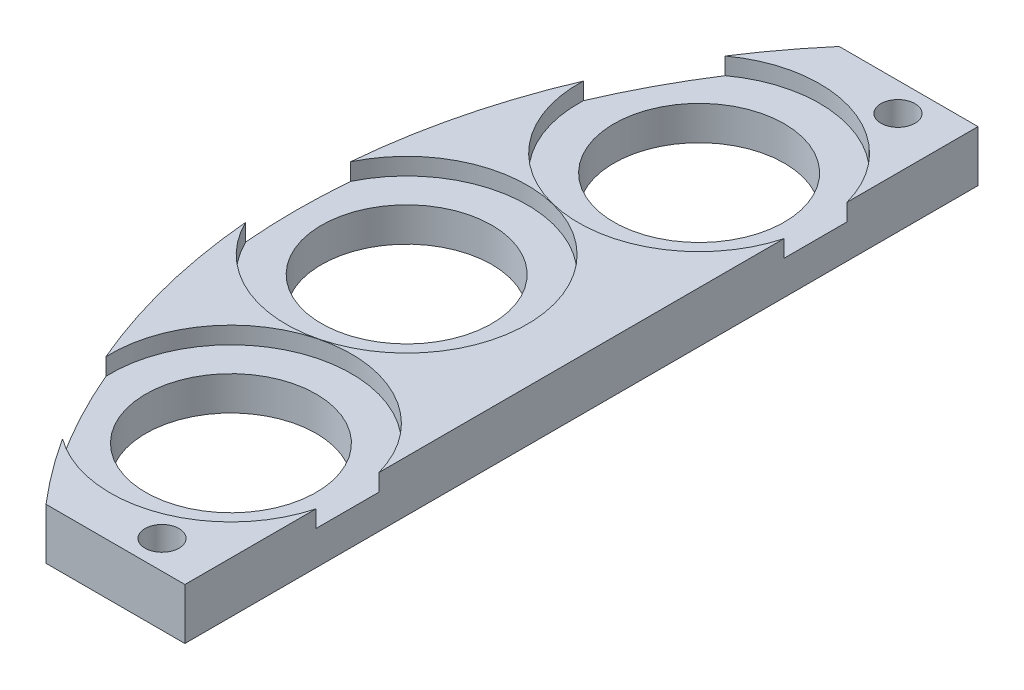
ISO-10303-21;
HEADER;
FILE_DESCRIPTION(('STEP AP214'),'2;1');
FILE_NAME('part.step','',(''),(''),'','','');
FILE_SCHEMA(('AUTOMOTIVE_DESIGN { 1 0 10303 214 1 1 1 1 }'));
ENDSEC;
DATA;
#1=APPLICATION_CONTEXT('core data for automotive mechanical design processes');
#2=APPLICATION_PROTOCOL_DEFINITION('international standard','automotive_design',2000,#1);
#3=PRODUCT_CONTEXT('',#1,'mechanical');
#4=PRODUCT('Part','Part','',(#3));
#5=PRODUCT_RELATED_PRODUCT_CATEGORY('part','',(#4));
#6=PRODUCT_DEFINITION_FORMATION('','',#4);
#7=PRODUCT_DEFINITION_CONTEXT('part definition',#1,'design');
#8=PRODUCT_DEFINITION('design','',#6,#7);
#9=PRODUCT_DEFINITION_SHAPE('','',#8);
#10=(LENGTH_UNIT() NAMED_UNIT(*) SI_UNIT(.MILLI.,.METRE.));
#11=(NAMED_UNIT(*) PLANE_ANGLE_UNIT() SI_UNIT($,.RADIAN.));
#12=(NAMED_UNIT(*) SI_UNIT($,.STERADIAN.) SOLID_ANGLE_UNIT());
#13=UNCERTAINTY_MEASURE_WITH_UNIT(LENGTH_MEASURE(1.E-05),#10,'distance_accuracy_value','');
#14=(GEOMETRIC_REPRESENTATION_CONTEXT(3) GLOBAL_UNCERTAINTY_ASSIGNED_CONTEXT((#13)) GLOBAL_UNIT_ASSIGNED_CONTEXT((#10,
#11,#12)) REPRESENTATION_CONTEXT('',''));
#15=CARTESIAN_POINT('',(0.,0.,0.));
#16=DIRECTION('',(0.,0.,1.));
#17=DIRECTION('',(1.,0.,0.));
#18=AXIS2_PLACEMENT_3D('',#15,#16,#17);
#19=CARTESIAN_POINT('',(0.,4.7625,0.));
#20=DIRECTION('',(0.,1.,0.));
#21=DIRECTION('',(0.,0.,1.));
#22=AXIS2_PLACEMENT_3D('',#19,#20,#21);
#23=PLANE('',#22);
#24=CARTESIAN_POINT('',(-40.9991196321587,4.7625,21.7996185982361));
#25=DIRECTION('',(0.,1.,0.));
#26=DIRECTION('',(0.,0.,1.));
#27=AXIS2_PLACEMENT_3D('',#24,#25,#26);
#28=CIRCLE('',#27,11.2268);
#29=CARTESIAN_POINT('',(-30.1625,4.7625,18.8655577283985));
#30=VERTEX_POINT('',#29);
#31=CARTESIAN_POINT('',(-52.2176106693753,4.7625,22.2314716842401));
#32=VERTEX_POINT('',#31);
#33=EDGE_CURVE('E154',#30,#32,#28,.T.);
#34=ORIENTED_EDGE('',*,*,#33,.F.);
#35=DIRECTION('',(0.,0.,-1.));
#36=VECTOR('',#35,1.);
#37=CARTESIAN_POINT('',(-30.1625,4.7625,-36.93795));
#38=LINE('',#37,#36);
#39=CARTESIAN_POINT('',(-30.1625,4.7625,-18.8655577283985));
#40=VERTEX_POINT('',#39);
#41=EDGE_CURVE('E170',#30,#40,#38,.T.);
#42=ORIENTED_EDGE('',*,*,#41,.T.);
#43=CARTESIAN_POINT('',(-40.9991196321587,4.7625,-21.7996185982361));
#44=DIRECTION('',(0.,1.,0.));
#45=DIRECTION('',(0.,0.,1.));
#46=AXIS2_PLACEMENT_3D('',#43,#44,#45);
#47=CIRCLE('',#46,11.2268);
#48=CARTESIAN_POINT('',(-52.2176106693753,4.7625,-22.2314716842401));
#49=VERTEX_POINT('',#48);
#50=EDGE_CURVE('E211',#49,#40,#47,.T.);
#51=ORIENTED_EDGE('',*,*,#50,.F.);
#52=CARTESIAN_POINT('',(0.,4.7625,0.));
#53=DIRECTION('',(0.,1.,0.));
#54=DIRECTION('',(0.,0.,1.));
#55=AXIS2_PLACEMENT_3D('',#52,#53,#54);
#56=CIRCLE('',#55,56.753125);
#57=CARTESIAN_POINT('',(-56.5424574,4.7625,-4.88545887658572));
#58=VERTEX_POINT('',#57);
#59=EDGE_CURVE('E185',#49,#58,#56,.T.);
#60=ORIENTED_EDGE('',*,*,#59,.T.);
#61=CARTESIAN_POINT('',(-46.434375,4.7625,0.));
#62=DIRECTION('',(0.,1.,0.));
#63=DIRECTION('',(0.,0.,1.));
#64=AXIS2_PLACEMENT_3D('',#61,#62,#63);
#65=CIRCLE('',#64,11.2268);
#66=CARTESIAN_POINT('',(-56.5424574,4.7625,4.88545887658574));
#67=VERTEX_POINT('',#66);
#68=EDGE_CURVE('E222',#67,#58,#65,.T.);
#69=ORIENTED_EDGE('',*,*,#68,.F.);
#70=EDGE_CURVE('E402',#67,#32,#56,.T.);
#71=ORIENTED_EDGE('',*,*,#70,.T.);
#72=EDGE_LOOP('',(#34,#42,#51,#60,#69,#71));
#73=FACE_BOUND('',#72,.T.);
#74=ADVANCED_FACE('F38',(#73),#23,.T.);
#75=CARTESIAN_POINT('',(-40.9991196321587,4.7625,21.7996185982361));
#76=DIRECTION('',(0.,-1.,0.));
#77=DIRECTION('',(0.,0.,-1.));
#78=AXIS2_PLACEMENT_3D('',#75,#76,#77);
#79=CYLINDRICAL_SURFACE('',#78,7.9375);
#80=CARTESIAN_POINT('',(-40.9991196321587,0.,21.7996185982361));
#81=DIRECTION('',(0.,1.,0.));
#82=DIRECTION('',(0.,0.,1.));
#83=AXIS2_PLACEMENT_3D('',#80,#81,#82);
#84=CIRCLE('',#83,7.9375);
#85=CARTESIAN_POINT('',(-40.9991196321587,0.,13.8621185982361));
#86=VERTEX_POINT('',#85);
#87=EDGE_CURVE('E196',#86,#86,#84,.T.);
#88=CARTESIAN_POINT('',(-40.9991196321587,3.175,21.7996185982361));
#89=DIRECTION('',(0.,1.,0.));
#90=DIRECTION('',(0.,0.,1.));
#91=AXIS2_PLACEMENT_3D('',#88,#89,#90);
#92=CIRCLE('',#91,7.9375);
#93=CARTESIAN_POINT('',(-40.9991196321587,3.175,13.8621185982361));
#94=VERTEX_POINT('',#93);
#95=EDGE_CURVE('E234',#94,#94,#92,.T.);
#96=CARTESIAN_POINT('',(-40.9991196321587,0.,13.8621185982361));
#97=CARTESIAN_POINT('',(-40.9991196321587,0.0330729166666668,13.8621185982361));
#98=CARTESIAN_POINT('',(-40.9991196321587,0.0661458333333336,13.8621185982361));
#99=CARTESIAN_POINT('',(-40.9991196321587,0.132291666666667,13.8621185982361));
#100=CARTESIAN_POINT('',(-40.9991196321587,0.165364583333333,13.8621185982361));
#101=CARTESIAN_POINT('',(-40.9991196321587,0.231510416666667,13.8621185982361));
#102=CARTESIAN_POINT('',(-40.9991196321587,0.264583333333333,13.8621185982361));
#103=CARTESIAN_POINT('',(-40.9991196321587,0.330729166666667,13.8621185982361));
#104=CARTESIAN_POINT('',(-40.9991196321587,0.363802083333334,13.8621185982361));
#105=CARTESIAN_POINT('',(-40.9991196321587,0.429947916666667,13.8621185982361));
#106=CARTESIAN_POINT('',(-40.9991196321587,0.463020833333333,13.8621185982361));
#107=CARTESIAN_POINT('',(-40.9991196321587,0.529166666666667,13.8621185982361));
#108=CARTESIAN_POINT('',(-40.9991196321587,0.562239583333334,13.8621185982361));
#109=CARTESIAN_POINT('',(-40.9991196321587,0.628385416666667,13.8621185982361));
#110=CARTESIAN_POINT('',(-40.9991196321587,0.661458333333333,13.8621185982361));
#111=CARTESIAN_POINT('',(-40.9991196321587,0.727604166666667,13.8621185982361));
#112=CARTESIAN_POINT('',(-40.9991196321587,0.760677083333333,13.8621185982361));
#113=CARTESIAN_POINT('',(-40.9991196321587,0.826822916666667,13.8621185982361));
#114=CARTESIAN_POINT('',(-40.9991196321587,0.859895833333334,13.8621185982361));
#115=CARTESIAN_POINT('',(-40.9991196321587,0.926041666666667,13.8621185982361));
#116=CARTESIAN_POINT('',(-40.9991196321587,0.959114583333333,13.8621185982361));
#117=CARTESIAN_POINT('',(-40.9991196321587,1.02526041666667,13.8621185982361));
#118=CARTESIAN_POINT('',(-40.9991196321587,1.05833333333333,13.8621185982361));
#119=CARTESIAN_POINT('',(-40.9991196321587,1.12447916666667,13.8621185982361));
#120=CARTESIAN_POINT('',(-40.9991196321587,1.15755208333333,13.8621185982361));
#121=CARTESIAN_POINT('',(-40.9991196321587,1.22369791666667,13.8621185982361));
#122=CARTESIAN_POINT('',(-40.9991196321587,1.25677083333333,13.8621185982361));
#123=CARTESIAN_POINT('',(-40.9991196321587,1.32291666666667,13.8621185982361));
#124=CARTESIAN_POINT('',(-40.9991196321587,1.35598958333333,13.8621185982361));
#125=CARTESIAN_POINT('',(-40.9991196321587,1.42213541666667,13.8621185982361));
#126=CARTESIAN_POINT('',(-40.9991196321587,1.45520833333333,13.8621185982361));
#127=CARTESIAN_POINT('',(-40.9991196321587,1.52135416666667,13.8621185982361));
#128=CARTESIAN_POINT('',(-40.9991196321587,1.55442708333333,13.8621185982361));
#129=CARTESIAN_POINT('',(-40.9991196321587,1.62057291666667,13.8621185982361));
#130=CARTESIAN_POINT('',(-40.9991196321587,1.65364583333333,13.8621185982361));
#131=CARTESIAN_POINT('',(-40.9991196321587,1.71979166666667,13.8621185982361));
#132=CARTESIAN_POINT('',(-40.9991196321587,1.75286458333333,13.8621185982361));
#133=CARTESIAN_POINT('',(-40.9991196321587,1.81901041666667,13.8621185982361));
#134=CARTESIAN_POINT('',(-40.9991196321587,1.85208333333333,13.8621185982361));
#135=CARTESIAN_POINT('',(-40.9991196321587,1.91822916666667,13.8621185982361));
#136=CARTESIAN_POINT('',(-40.9991196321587,1.95130208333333,13.8621185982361));
#137=CARTESIAN_POINT('',(-40.9991196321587,2.01744791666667,13.8621185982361));
#138=CARTESIAN_POINT('',(-40.9991196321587,2.05052083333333,13.8621185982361));
#139=CARTESIAN_POINT('',(-40.9991196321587,2.11666666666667,13.8621185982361));
#140=CARTESIAN_POINT('',(-40.9991196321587,2.14973958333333,13.8621185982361));
#141=CARTESIAN_POINT('',(-40.9991196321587,2.21588541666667,13.8621185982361));
#142=CARTESIAN_POINT('',(-40.9991196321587,2.24895833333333,13.8621185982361));
#143=CARTESIAN_POINT('',(-40.9991196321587,2.31510416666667,13.8621185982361));
#144=CARTESIAN_POINT('',(-40.9991196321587,2.34817708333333,13.8621185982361));
#145=CARTESIAN_POINT('',(-40.9991196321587,2.41432291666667,13.8621185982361));
#146=CARTESIAN_POINT('',(-40.9991196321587,2.44739583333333,13.8621185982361));
#147=CARTESIAN_POINT('',(-40.9991196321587,2.51354166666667,13.8621185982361));
#148=CARTESIAN_POINT('',(-40.9991196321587,2.54661458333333,13.8621185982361));
#149=CARTESIAN_POINT('',(-40.9991196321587,2.61276041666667,13.8621185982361));
#150=CARTESIAN_POINT('',(-40.9991196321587,2.64583333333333,13.8621185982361));
#151=CARTESIAN_POINT('',(-40.9991196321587,2.71197916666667,13.8621185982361));
#152=CARTESIAN_POINT('',(-40.9991196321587,2.74505208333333,13.8621185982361));
#153=CARTESIAN_POINT('',(-40.9991196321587,2.81119791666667,13.8621185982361));
#154=CARTESIAN_POINT('',(-40.9991196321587,2.84427083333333,13.8621185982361));
#155=CARTESIAN_POINT('',(-40.9991196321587,2.91041666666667,13.8621185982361));
#156=CARTESIAN_POINT('',(-40.9991196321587,2.94348958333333,13.8621185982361));
#157=CARTESIAN_POINT('',(-40.9991196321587,3.00963541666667,13.8621185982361));
#158=CARTESIAN_POINT('',(-40.9991196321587,3.04270833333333,13.8621185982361));
#159=CARTESIAN_POINT('',(-40.9991196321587,3.10885416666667,13.8621185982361));
#160=CARTESIAN_POINT('',(-40.9991196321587,3.14192708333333,13.8621185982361));
#161=CARTESIAN_POINT('',(-40.9991196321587,3.175,13.8621185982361));
#162=B_SPLINE_CURVE_WITH_KNOTS('',3,(#96,#97,#98,#99,#100,#101,#102,#103,#104,#105,#106,#107,
#108,#109,#110,#111,#112,#113,#114,#115,#116,#117,#118,#119,#120,#121,#122,#123,#124,#125,#126,
#127,#128,#129,#130,#131,#132,#133,#134,#135,#136,#137,#138,#139,#140,#141,#142,#143,#144,#145,
#146,#147,#148,#149,#150,#151,#152,#153,#154,#155,#156,#157,#158,#159,#160,#161),.UNSPECIFIED.,
.F.,.F.,(4,2,2,2,2,2,2,2,2,2,2,2,2,2,2,2,2,2,2,2,2,2,2,2,2,2,2,2,2,2,2,2,4),(0.,
0.0992187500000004,0.1984375,0.29765625,0.396875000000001,0.49609375,0.5953125,0.69453125,
0.79375,0.89296875,0.9921875,1.09140625,1.190625,1.28984375,1.3890625,1.48828125,1.5875,
1.68671875,1.7859375,1.88515625,1.984375,2.08359375,2.1828125,2.28203125,2.38125,2.48046875,
2.5796875,2.67890625,2.778125,2.87734375,2.9765625,3.07578125,3.175),.UNSPECIFIED.);
#163=EDGE_CURVE('BSEAM265',#86,#94,#162,.T.);
#164=ORIENTED_EDGE('',*,*,#87,.F.);
#165=ORIENTED_EDGE('',*,*,#95,.T.);
#166=ORIENTED_EDGE('',*,*,#163,.T.);
#167=ORIENTED_EDGE('',*,*,#163,.F.);
#168=EDGE_LOOP('',(#164,#166,#165,#167));
#169=FACE_BOUND('',#168,.T.);
#170=ADVANCED_FACE('F265',(#169),#79,.F.);
#171=CARTESIAN_POINT('',(-46.434375,4.7625,0.));
#172=DIRECTION('',(0.,-1.,0.));
#173=DIRECTION('',(0.,0.,-1.));
#174=AXIS2_PLACEMENT_3D('',#171,#172,#173);
#175=CYLINDRICAL_SURFACE('',#174,7.9375);
#176=CARTESIAN_POINT('',(-46.434375,0.,0.));
#177=DIRECTION('',(0.,1.,0.));
#178=DIRECTION('',(0.,0.,1.));
#179=AXIS2_PLACEMENT_3D('',#176,#177,#178);
#180=CIRCLE('',#179,7.9375);
#181=CARTESIAN_POINT('',(-46.434375,0.,-7.9375));
#182=VERTEX_POINT('',#181);
#183=EDGE_CURVE('E189',#182,#182,#180,.T.);
#184=CARTESIAN_POINT('',(-46.434375,3.175,0.));
#185=DIRECTION('',(0.,1.,0.));
#186=DIRECTION('',(0.,0.,1.));
#187=AXIS2_PLACEMENT_3D('',#184,#185,#186);
#188=CIRCLE('',#187,7.9375);
#189=CARTESIAN_POINT('',(-46.434375,3.175,-7.9375));
#190=VERTEX_POINT('',#189);
#191=EDGE_CURVE('E221',#190,#190,#188,.T.);
#192=CARTESIAN_POINT('',(-46.434375,0.,-7.9375));
#193=CARTESIAN_POINT('',(-46.434375,0.0330729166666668,-7.9375));
#194=CARTESIAN_POINT('',(-46.434375,0.0661458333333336,-7.9375));
#195=CARTESIAN_POINT('',(-46.434375,0.132291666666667,-7.9375));
#196=CARTESIAN_POINT('',(-46.434375,0.165364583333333,-7.9375));
#197=CARTESIAN_POINT('',(-46.434375,0.231510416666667,-7.9375));
#198=CARTESIAN_POINT('',(-46.434375,0.264583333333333,-7.9375));
#199=CARTESIAN_POINT('',(-46.434375,0.330729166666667,-7.9375));
#200=CARTESIAN_POINT('',(-46.434375,0.363802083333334,-7.9375));
#201=CARTESIAN_POINT('',(-46.434375,0.429947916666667,-7.9375));
#202=CARTESIAN_POINT('',(-46.434375,0.463020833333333,-7.9375));
#203=CARTESIAN_POINT('',(-46.434375,0.529166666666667,-7.9375));
#204=CARTESIAN_POINT('',(-46.434375,0.562239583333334,-7.9375));
#205=CARTESIAN_POINT('',(-46.434375,0.628385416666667,-7.9375));
#206=CARTESIAN_POINT('',(-46.434375,0.661458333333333,-7.9375));
#207=CARTESIAN_POINT('',(-46.434375,0.727604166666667,-7.9375));
#208=CARTESIAN_POINT('',(-46.434375,0.760677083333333,-7.9375));
#209=CARTESIAN_POINT('',(-46.434375,0.826822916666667,-7.9375));
#210=CARTESIAN_POINT('',(-46.434375,0.859895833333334,-7.9375));
#211=CARTESIAN_POINT('',(-46.434375,0.926041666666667,-7.9375));
#212=CARTESIAN_POINT('',(-46.434375,0.959114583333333,-7.9375));
#213=CARTESIAN_POINT('',(-46.434375,1.02526041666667,-7.9375));
#214=CARTESIAN_POINT('',(-46.434375,1.05833333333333,-7.9375));
#215=CARTESIAN_POINT('',(-46.434375,1.12447916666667,-7.9375));
#216=CARTESIAN_POINT('',(-46.434375,1.15755208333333,-7.9375));
#217=CARTESIAN_POINT('',(-46.434375,1.22369791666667,-7.9375));
#218=CARTESIAN_POINT('',(-46.434375,1.25677083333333,-7.9375));
#219=CARTESIAN_POINT('',(-46.434375,1.32291666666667,-7.9375));
#220=CARTESIAN_POINT('',(-46.434375,1.35598958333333,-7.9375));
#221=CARTESIAN_POINT('',(-46.434375,1.42213541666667,-7.9375));
#222=CARTESIAN_POINT('',(-46.434375,1.45520833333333,-7.9375));
#223=CARTESIAN_POINT('',(-46.434375,1.52135416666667,-7.9375));
#224=CARTESIAN_POINT('',(-46.434375,1.55442708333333,-7.9375));
#225=CARTESIAN_POINT('',(-46.434375,1.62057291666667,-7.9375));
#226=CARTESIAN_POINT('',(-46.434375,1.65364583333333,-7.9375));
#227=CARTESIAN_POINT('',(-46.434375,1.71979166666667,-7.9375));
#228=CARTESIAN_POINT('',(-46.434375,1.75286458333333,-7.9375));
#229=CARTESIAN_POINT('',(-46.434375,1.81901041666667,-7.9375));
#230=CARTESIAN_POINT('',(-46.434375,1.85208333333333,-7.9375));
#231=CARTESIAN_POINT('',(-46.434375,1.91822916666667,-7.9375));
#232=CARTESIAN_POINT('',(-46.434375,1.95130208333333,-7.9375));
#233=CARTESIAN_POINT('',(-46.434375,2.01744791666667,-7.9375));
#234=CARTESIAN_POINT('',(-46.434375,2.05052083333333,-7.9375));
#235=CARTESIAN_POINT('',(-46.434375,2.11666666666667,-7.9375));
#236=CARTESIAN_POINT('',(-46.434375,2.14973958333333,-7.9375));
#237=CARTESIAN_POINT('',(-46.434375,2.21588541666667,-7.9375));
#238=CARTESIAN_POINT('',(-46.434375,2.24895833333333,-7.9375));
#239=CARTESIAN_POINT('',(-46.434375,2.31510416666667,-7.9375));
#240=CARTESIAN_POINT('',(-46.434375,2.34817708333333,-7.9375));
#241=CARTESIAN_POINT('',(-46.434375,2.41432291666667,-7.9375));
#242=CARTESIAN_POINT('',(-46.434375,2.44739583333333,-7.9375));
#243=CARTESIAN_POINT('',(-46.434375,2.51354166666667,-7.9375));
#244=CARTESIAN_POINT('',(-46.434375,2.54661458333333,-7.9375));
#245=CARTESIAN_POINT('',(-46.434375,2.61276041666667,-7.9375));
#246=CARTESIAN_POINT('',(-46.434375,2.64583333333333,-7.9375));
#247=CARTESIAN_POINT('',(-46.434375,2.71197916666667,-7.9375));
#248=CARTESIAN_POINT('',(-46.434375,2.74505208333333,-7.9375));
#249=CARTESIAN_POINT('',(-46.434375,2.81119791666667,-7.9375));
#250=CARTESIAN_POINT('',(-46.434375,2.84427083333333,-7.9375));
#251=CARTESIAN_POINT('',(-46.434375,2.91041666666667,-7.9375));
#252=CARTESIAN_POINT('',(-46.434375,2.94348958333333,-7.9375));
#253=CARTESIAN_POINT('',(-46.434375,3.00963541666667,-7.9375));
#254=CARTESIAN_POINT('',(-46.434375,3.04270833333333,-7.9375));
#255=CARTESIAN_POINT('',(-46.434375,3.10885416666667,-7.9375));
#256=CARTESIAN_POINT('',(-46.434375,3.14192708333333,-7.9375));
#257=CARTESIAN_POINT('',(-46.434375,3.175,-7.9375));
#258=B_SPLINE_CURVE_WITH_KNOTS('',3,(#192,#193,#194,#195,#196,#197,#198,#199,#200,#201,#202,
#203,#204,#205,#206,#207,#208,#209,#210,#211,#212,#213,#214,#215,#216,#217,#218,#219,#220,#221,
#222,#223,#224,#225,#226,#227,#228,#229,#230,#231,#232,#233,#234,#235,#236,#237,#238,#239,#240,
#241,#242,#243,#244,#245,#246,#247,#248,#249,#250,#251,#252,#253,#254,#255,#256,#257),
.UNSPECIFIED.,.F.,.F.,(4,2,2,2,2,2,2,2,2,2,2,2,2,2,2,2,2,2,2,2,2,2,2,2,2,2,2,2,2,2,2,2,4),(0.,
0.0992187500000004,0.1984375,0.29765625,0.396875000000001,0.49609375,0.5953125,0.69453125,
0.79375,0.89296875,0.9921875,1.09140625,1.190625,1.28984375,1.3890625,1.48828125,1.5875,
1.68671875,1.7859375,1.88515625,1.984375,2.08359375,2.1828125,2.28203125,2.38125,2.48046875,
2.5796875,2.67890625,2.778125,2.87734375,2.9765625,3.07578125,3.175),.UNSPECIFIED.);
#259=EDGE_CURVE('BSEAM272',#182,#190,#258,.T.);
#260=ORIENTED_EDGE('',*,*,#183,.F.);
#261=ORIENTED_EDGE('',*,*,#191,.T.);
#262=ORIENTED_EDGE('',*,*,#259,.T.);
#263=ORIENTED_EDGE('',*,*,#259,.F.);
#264=EDGE_LOOP('',(#260,#262,#261,#263));
#265=FACE_BOUND('',#264,.T.);
#266=ADVANCED_FACE('F272',(#265),#175,.F.);
#267=CARTESIAN_POINT('',(-34.948790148,4.7625,-34.27095));
#268=DIRECTION('',(0.,1.,0.));
#269=DIRECTION('',(0.,0.,1.));
#270=AXIS2_PLACEMENT_3D('',#267,#268,#269);
#271=CIRCLE('',#270,1.5875);
#272=CARTESIAN_POINT('',(-34.948790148,4.7625,-32.68345));
#273=VERTEX_POINT('',#272);
#274=EDGE_CURVE('E244',#273,#273,#271,.T.);
#275=ORIENTED_EDGE('',*,*,#274,.F.);
#276=EDGE_LOOP('',(#275));
#277=FACE_BOUND('',#276,.T.);
#278=CARTESIAN_POINT('',(-30.1625,4.7625,-24.7336794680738));
#279=VERTEX_POINT('',#278);
#280=CARTESIAN_POINT('',(-47.6304426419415,4.7625,-30.8586799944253));
#281=VERTEX_POINT('',#280);
#282=EDGE_CURVE('E214',#279,#281,#47,.T.);
#283=ORIENTED_EDGE('',*,*,#282,.F.);
#284=CARTESIAN_POINT('',(-30.1625,4.7625,-36.93795));
#285=VERTEX_POINT('',#284);
#286=EDGE_CURVE('E172',#279,#285,#38,.T.);
#287=ORIENTED_EDGE('',*,*,#286,.T.);
#288=DIRECTION('',(-1.,0.,0.));
#289=VECTOR('',#288,1.);
#290=CARTESIAN_POINT('',(-43.0871796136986,4.7625,-36.93795));
#291=LINE('',#290,#289);
#292=CARTESIAN_POINT('',(-43.0871796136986,4.7625,-36.93795));
#293=VERTEX_POINT('',#292);
#294=EDGE_CURVE('E169',#285,#293,#291,.T.);
#295=ORIENTED_EDGE('',*,*,#294,.T.);
#296=EDGE_CURVE('E182',#293,#281,#56,.T.);
#297=ORIENTED_EDGE('',*,*,#296,.T.);
#298=EDGE_LOOP('',(#283,#287,#295,#297));
#299=FACE_BOUND('',#298,.T.);
#300=ADVANCED_FACE('F268',(#277,#299),#23,.T.);
#301=CARTESIAN_POINT('',(-40.9991196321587,4.7625,-21.7996185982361));
#302=DIRECTION('',(0.,-1.,0.));
#303=DIRECTION('',(0.,0.,-1.));
#304=AXIS2_PLACEMENT_3D('',#301,#302,#303);
#305=CYLINDRICAL_SURFACE('',#304,7.9375);
#306=CARTESIAN_POINT('',(-40.9991196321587,0.,-21.7996185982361));
#307=DIRECTION('',(0.,1.,0.));
#308=DIRECTION('',(0.,0.,1.));
#309=AXIS2_PLACEMENT_3D('',#306,#307,#308);
#310=CIRCLE('',#309,7.9375);
#311=CARTESIAN_POINT('',(-40.9991196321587,0.,-29.7371185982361));
#312=VERTEX_POINT('',#311);
#313=EDGE_CURVE('E193',#312,#312,#310,.T.);
#314=CARTESIAN_POINT('',(-40.9991196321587,3.175,-21.7996185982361));
#315=DIRECTION('',(0.,1.,0.));
#316=DIRECTION('',(0.,0.,1.));
#317=AXIS2_PLACEMENT_3D('',#314,#315,#316);
#318=CIRCLE('',#317,7.9375);
#319=CARTESIAN_POINT('',(-40.9991196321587,3.175,-29.7371185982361));
#320=VERTEX_POINT('',#319);
#321=EDGE_CURVE('E210',#320,#320,#318,.T.);
#322=CARTESIAN_POINT('',(-40.9991196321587,0.,-29.7371185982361));
#323=CARTESIAN_POINT('',(-40.9991196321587,0.0330729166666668,-29.7371185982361));
#324=CARTESIAN_POINT('',(-40.9991196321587,0.0661458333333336,-29.7371185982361));
#325=CARTESIAN_POINT('',(-40.9991196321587,0.132291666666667,-29.7371185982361));
#326=CARTESIAN_POINT('',(-40.9991196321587,0.165364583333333,-29.7371185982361));
#327=CARTESIAN_POINT('',(-40.9991196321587,0.231510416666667,-29.7371185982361));
#328=CARTESIAN_POINT('',(-40.9991196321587,0.264583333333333,-29.7371185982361));
#329=CARTESIAN_POINT('',(-40.9991196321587,0.330729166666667,-29.7371185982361));
#330=CARTESIAN_POINT('',(-40.9991196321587,0.363802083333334,-29.7371185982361));
#331=CARTESIAN_POINT('',(-40.9991196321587,0.429947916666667,-29.7371185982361));
#332=CARTESIAN_POINT('',(-40.9991196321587,0.463020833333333,-29.7371185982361));
#333=CARTESIAN_POINT('',(-40.9991196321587,0.529166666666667,-29.7371185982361));
#334=CARTESIAN_POINT('',(-40.9991196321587,0.562239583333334,-29.7371185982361));
#335=CARTESIAN_POINT('',(-40.9991196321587,0.628385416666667,-29.7371185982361));
#336=CARTESIAN_POINT('',(-40.9991196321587,0.661458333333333,-29.7371185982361));
#337=CARTESIAN_POINT('',(-40.9991196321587,0.727604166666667,-29.7371185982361));
#338=CARTESIAN_POINT('',(-40.9991196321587,0.760677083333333,-29.7371185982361));
#339=CARTESIAN_POINT('',(-40.9991196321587,0.826822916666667,-29.7371185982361));
#340=CARTESIAN_POINT('',(-40.9991196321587,0.859895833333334,-29.7371185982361));
#341=CARTESIAN_POINT('',(-40.9991196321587,0.926041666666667,-29.7371185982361));
#342=CARTESIAN_POINT('',(-40.9991196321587,0.959114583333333,-29.7371185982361));
#343=CARTESIAN_POINT('',(-40.9991196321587,1.02526041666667,-29.7371185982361));
#344=CARTESIAN_POINT('',(-40.9991196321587,1.05833333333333,-29.7371185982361));
#345=CARTESIAN_POINT('',(-40.9991196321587,1.12447916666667,-29.7371185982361));
#346=CARTESIAN_POINT('',(-40.9991196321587,1.15755208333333,-29.7371185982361));
#347=CARTESIAN_POINT('',(-40.9991196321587,1.22369791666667,-29.7371185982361));
#348=CARTESIAN_POINT('',(-40.9991196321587,1.25677083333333,-29.7371185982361));
#349=CARTESIAN_POINT('',(-40.9991196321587,1.32291666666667,-29.7371185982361));
#350=CARTESIAN_POINT('',(-40.9991196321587,1.35598958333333,-29.7371185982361));
#351=CARTESIAN_POINT('',(-40.9991196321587,1.42213541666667,-29.7371185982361));
#352=CARTESIAN_POINT('',(-40.9991196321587,1.45520833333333,-29.7371185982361));
#353=CARTESIAN_POINT('',(-40.9991196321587,1.52135416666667,-29.7371185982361));
#354=CARTESIAN_POINT('',(-40.9991196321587,1.55442708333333,-29.7371185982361));
#355=CARTESIAN_POINT('',(-40.9991196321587,1.62057291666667,-29.7371185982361));
#356=CARTESIAN_POINT('',(-40.9991196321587,1.65364583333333,-29.7371185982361));
#357=CARTESIAN_POINT('',(-40.9991196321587,1.71979166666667,-29.7371185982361));
#358=CARTESIAN_POINT('',(-40.9991196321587,1.75286458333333,-29.7371185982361));
#359=CARTESIAN_POINT('',(-40.9991196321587,1.81901041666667,-29.7371185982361));
#360=CARTESIAN_POINT('',(-40.9991196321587,1.85208333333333,-29.7371185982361));
#361=CARTESIAN_POINT('',(-40.9991196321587,1.91822916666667,-29.7371185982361));
#362=CARTESIAN_POINT('',(-40.9991196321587,1.95130208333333,-29.7371185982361));
#363=CARTESIAN_POINT('',(-40.9991196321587,2.01744791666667,-29.7371185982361));
#364=CARTESIAN_POINT('',(-40.9991196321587,2.05052083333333,-29.7371185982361));
#365=CARTESIAN_POINT('',(-40.9991196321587,2.11666666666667,-29.7371185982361));
#366=CARTESIAN_POINT('',(-40.9991196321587,2.14973958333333,-29.7371185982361));
#367=CARTESIAN_POINT('',(-40.9991196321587,2.21588541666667,-29.7371185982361));
#368=CARTESIAN_POINT('',(-40.9991196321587,2.24895833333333,-29.7371185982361));
#369=CARTESIAN_POINT('',(-40.9991196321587,2.31510416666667,-29.7371185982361));
#370=CARTESIAN_POINT('',(-40.9991196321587,2.34817708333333,-29.7371185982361));
#371=CARTESIAN_POINT('',(-40.9991196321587,2.41432291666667,-29.7371185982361));
#372=CARTESIAN_POINT('',(-40.9991196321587,2.44739583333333,-29.7371185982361));
#373=CARTESIAN_POINT('',(-40.9991196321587,2.51354166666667,-29.7371185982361));
#374=CARTESIAN_POINT('',(-40.9991196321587,2.54661458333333,-29.7371185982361));
#375=CARTESIAN_POINT('',(-40.9991196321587,2.61276041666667,-29.7371185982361));
#376=CARTESIAN_POINT('',(-40.9991196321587,2.64583333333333,-29.7371185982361));
#377=CARTESIAN_POINT('',(-40.9991196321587,2.71197916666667,-29.7371185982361));
#378=CARTESIAN_POINT('',(-40.9991196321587,2.74505208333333,-29.7371185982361));
#379=CARTESIAN_POINT('',(-40.9991196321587,2.81119791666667,-29.7371185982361));
#380=CARTESIAN_POINT('',(-40.9991196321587,2.84427083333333,-29.7371185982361));
#381=CARTESIAN_POINT('',(-40.9991196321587,2.91041666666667,-29.7371185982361));
#382=CARTESIAN_POINT('',(-40.9991196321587,2.94348958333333,-29.7371185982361));
#383=CARTESIAN_POINT('',(-40.9991196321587,3.00963541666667,-29.7371185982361));
#384=CARTESIAN_POINT('',(-40.9991196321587,3.04270833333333,-29.7371185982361));
#385=CARTESIAN_POINT('',(-40.9991196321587,3.10885416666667,-29.7371185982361));
#386=CARTESIAN_POINT('',(-40.9991196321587,3.14192708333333,-29.7371185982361));
#387=CARTESIAN_POINT('',(-40.9991196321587,3.175,-29.7371185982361));
#388=B_SPLINE_CURVE_WITH_KNOTS('',3,(#322,#323,#324,#325,#326,#327,#328,#329,#330,#331,#332,
#333,#334,#335,#336,#337,#338,#339,#340,#341,#342,#343,#344,#345,#346,#347,#348,#349,#350,#351,
#352,#353,#354,#355,#356,#357,#358,#359,#360,#361,#362,#363,#364,#365,#366,#367,#368,#369,#370,
#371,#372,#373,#374,#375,#376,#377,#378,#379,#380,#381,#382,#383,#384,#385,#386,#387),
.UNSPECIFIED.,.F.,.F.,(4,2,2,2,2,2,2,2,2,2,2,2,2,2,2,2,2,2,2,2,2,2,2,2,2,2,2,2,2,2,2,2,4),(0.,
0.0992187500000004,0.1984375,0.29765625,0.396875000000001,0.49609375,0.5953125,0.69453125,
0.79375,0.89296875,0.9921875,1.09140625,1.190625,1.28984375,1.3890625,1.48828125,1.5875,
1.68671875,1.7859375,1.88515625,1.984375,2.08359375,2.1828125,2.28203125,2.38125,2.48046875,
2.5796875,2.67890625,2.778125,2.87734375,2.9765625,3.07578125,3.175),.UNSPECIFIED.);
#389=EDGE_CURVE('BSEAM279',#312,#320,#388,.T.);
#390=ORIENTED_EDGE('',*,*,#313,.F.);
#391=ORIENTED_EDGE('',*,*,#321,.T.);
#392=ORIENTED_EDGE('',*,*,#389,.T.);
#393=ORIENTED_EDGE('',*,*,#389,.F.);
#394=EDGE_LOOP('',(#390,#392,#391,#393));
#395=FACE_BOUND('',#394,.T.);
#396=ADVANCED_FACE('F279',(#395),#305,.F.);
#397=CARTESIAN_POINT('',(-34.948790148,4.7625,34.27095));
#398=DIRECTION('',(0.,1.,0.));
#399=DIRECTION('',(0.,0.,1.));
#400=AXIS2_PLACEMENT_3D('',#397,#398,#399);
#401=CIRCLE('',#400,1.5875);
#402=CARTESIAN_POINT('',(-34.948790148,4.7625,35.85845));
#403=VERTEX_POINT('',#402);
#404=EDGE_CURVE('E241',#403,#403,#401,.T.);
#405=ORIENTED_EDGE('',*,*,#404,.F.);
#406=EDGE_LOOP('',(#405));
#407=FACE_BOUND('',#406,.T.);
#408=CARTESIAN_POINT('',(-47.6304426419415,4.7625,30.8586799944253));
#409=VERTEX_POINT('',#408);
#410=CARTESIAN_POINT('',(-30.1625,4.7625,24.7336794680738));
#411=VERTEX_POINT('',#410);
#412=EDGE_CURVE('E145',#409,#411,#28,.T.);
#413=ORIENTED_EDGE('',*,*,#412,.F.);
#414=CARTESIAN_POINT('',(-43.0980638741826,4.7625,36.92525));
#415=VERTEX_POINT('',#414);
#416=EDGE_CURVE('E187',#409,#415,#56,.T.);
#417=ORIENTED_EDGE('',*,*,#416,.T.);
#418=DIRECTION('',(1.,0.,0.));
#419=VECTOR('',#418,1.);
#420=CARTESIAN_POINT('',(-43.0980638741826,4.7625,36.92525));
#421=LINE('',#420,#419);
#422=CARTESIAN_POINT('',(-30.1625,4.7625,36.92525));
#423=VERTEX_POINT('',#422);
#424=EDGE_CURVE('E166',#415,#423,#421,.T.);
#425=ORIENTED_EDGE('',*,*,#424,.T.);
#426=EDGE_CURVE('E161',#423,#411,#38,.T.);
#427=ORIENTED_EDGE('',*,*,#426,.T.);
#428=EDGE_LOOP('',(#413,#417,#425,#427));
#429=FACE_BOUND('',#428,.T.);
#430=ADVANCED_FACE('F164',(#407,#429),#23,.T.);
#431=CARTESIAN_POINT('',(0.,0.,0.));
#432=DIRECTION('',(0.,1.,0.));
#433=DIRECTION('',(0.,0.,1.));
#434=AXIS2_PLACEMENT_3D('',#431,#432,#433);
#435=PLANE('',#434);
#436=CARTESIAN_POINT('',(-34.948790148,0.,-34.27095));
#437=DIRECTION('',(0.,1.,0.));
#438=DIRECTION('',(0.,0.,1.));
#439=AXIS2_PLACEMENT_3D('',#436,#437,#438);
#440=CIRCLE('',#439,1.5875);
#441=CARTESIAN_POINT('',(-34.948790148,0.,-32.68345));
#442=VERTEX_POINT('',#441);
#443=EDGE_CURVE('E42',#442,#442,#440,.T.);
#444=ORIENTED_EDGE('',*,*,#443,.T.);
#445=EDGE_LOOP('',(#444));
#446=FACE_BOUND('',#445,.T.);
#447=CARTESIAN_POINT('',(-34.948790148,0.,34.27095));
#448=DIRECTION('',(0.,1.,0.));
#449=DIRECTION('',(0.,0.,1.));
#450=AXIS2_PLACEMENT_3D('',#447,#448,#449);
#451=CIRCLE('',#450,1.5875);
#452=CARTESIAN_POINT('',(-34.948790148,0.,35.85845));
#453=VERTEX_POINT('',#452);
#454=EDGE_CURVE('E155',#453,#453,#451,.T.);
#455=ORIENTED_EDGE('',*,*,#454,.T.);
#456=EDGE_LOOP('',(#455));
#457=FACE_BOUND('',#456,.T.);
#458=ORIENTED_EDGE('',*,*,#313,.T.);
#459=EDGE_LOOP('',(#458));
#460=FACE_BOUND('',#459,.T.);
#461=CARTESIAN_POINT('',(0.,0.,0.));
#462=DIRECTION('',(0.,1.,0.));
#463=DIRECTION('',(0.,0.,1.));
#464=AXIS2_PLACEMENT_3D('',#461,#462,#463);
#465=CIRCLE('',#464,56.753125);
#466=CARTESIAN_POINT('',(-43.0871796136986,0.,-36.93795));
#467=VERTEX_POINT('',#466);
#468=CARTESIAN_POINT('',(-43.0980638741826,0.,36.92525));
#469=VERTEX_POINT('',#468);
#470=EDGE_CURVE('E192',#467,#469,#465,.T.);
#471=ORIENTED_EDGE('',*,*,#470,.F.);
#472=DIRECTION('',(-1.,0.,0.));
#473=VECTOR('',#472,1.);
#474=CARTESIAN_POINT('',(-43.0871796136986,0.,-36.93795));
#475=LINE('',#474,#473);
#476=CARTESIAN_POINT('',(-30.1625,0.,-36.93795));
#477=VERTEX_POINT('',#476);
#478=EDGE_CURVE('E345',#477,#467,#475,.T.);
#479=ORIENTED_EDGE('',*,*,#478,.F.);
#480=DIRECTION('',(0.,0.,-1.));
#481=VECTOR('',#480,1.);
#482=CARTESIAN_POINT('',(-30.1625,0.,-36.93795));
#483=LINE('',#482,#481);
#484=CARTESIAN_POINT('',(-30.1625,0.,36.92525));
#485=VERTEX_POINT('',#484);
#486=EDGE_CURVE('E347',#485,#477,#483,.T.);
#487=ORIENTED_EDGE('',*,*,#486,.F.);
#488=DIRECTION('',(1.,0.,0.));
#489=VECTOR('',#488,1.);
#490=CARTESIAN_POINT('',(-43.0980638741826,0.,36.92525));
#491=LINE('',#490,#489);
#492=EDGE_CURVE('E350',#469,#485,#491,.T.);
#493=ORIENTED_EDGE('',*,*,#492,.F.);
#494=EDGE_LOOP('',(#471,#479,#487,#493));
#495=FACE_BOUND('',#494,.T.);
#496=ORIENTED_EDGE('',*,*,#183,.T.);
#497=EDGE_LOOP('',(#496));
#498=FACE_BOUND('',#497,.T.);
#499=ORIENTED_EDGE('',*,*,#87,.T.);
#500=EDGE_LOOP('',(#499));
#501=FACE_BOUND('',#500,.T.);
#502=ADVANCED_FACE('F251',(#446,#457,#460,#495,#498,#501),#435,.F.);
#503=CARTESIAN_POINT('',(0.,4.7625,0.));
#504=DIRECTION('',(0.,-1.,0.));
#505=DIRECTION('',(0.,0.,-1.));
#506=AXIS2_PLACEMENT_3D('',#503,#504,#505);
#507=CYLINDRICAL_SURFACE('',#506,56.753125);
#508=CARTESIAN_POINT('',(0.,3.175,0.));
#509=DIRECTION('',(0.,1.,0.));
#510=DIRECTION('',(0.,0.,1.));
#511=AXIS2_PLACEMENT_3D('',#508,#509,#510);
#512=CIRCLE('',#511,56.753125);
#513=CARTESIAN_POINT('',(-52.2176106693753,3.175,22.2314716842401));
#514=VERTEX_POINT('',#513);
#515=CARTESIAN_POINT('',(-47.6304426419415,3.175,30.8586799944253));
#516=VERTEX_POINT('',#515);
#517=EDGE_CURVE('E231',#514,#516,#512,.T.);
#518=ORIENTED_EDGE('',*,*,#517,.F.);
#519=DIRECTION('',(0.,1.,0.));
#520=VECTOR('',#519,1.);
#521=CARTESIAN_POINT('',(-52.2176106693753,3.96875,22.23147168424));
#522=LINE('',#521,#520);
#523=EDGE_CURVE('E224',#514,#32,#522,.T.);
#524=ORIENTED_EDGE('',*,*,#523,.T.);
#525=ORIENTED_EDGE('',*,*,#70,.F.);
#526=DIRECTION('',(0.,1.,0.));
#527=VECTOR('',#526,1.);
#528=CARTESIAN_POINT('',(-56.5424574,3.96875,4.8854588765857));
#529=LINE('',#528,#527);
#530=CARTESIAN_POINT('',(-56.5424574,3.175,4.88545887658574));
#531=VERTEX_POINT('',#530);
#532=EDGE_CURVE('E316',#67,#531,#529,.F.);
#533=ORIENTED_EDGE('',*,*,#532,.T.);
#534=CARTESIAN_POINT('',(0.,3.175,0.));
#535=DIRECTION('',(0.,1.,0.));
#536=DIRECTION('',(0.,0.,1.));
#537=AXIS2_PLACEMENT_3D('',#534,#535,#536);
#538=CIRCLE('',#537,56.753125);
#539=CARTESIAN_POINT('',(-56.5424574,3.175,-4.88545887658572));
#540=VERTEX_POINT('',#539);
#541=EDGE_CURVE('E215',#540,#531,#538,.T.);
#542=ORIENTED_EDGE('',*,*,#541,.F.);
#543=DIRECTION('',(0.,1.,0.));
#544=VECTOR('',#543,1.);
#545=CARTESIAN_POINT('',(-56.5424574,3.96875,-4.88545887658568));
#546=LINE('',#545,#544);
#547=EDGE_CURVE('E312',#540,#58,#546,.T.);
#548=ORIENTED_EDGE('',*,*,#547,.T.);
#549=ORIENTED_EDGE('',*,*,#59,.F.);
#550=DIRECTION('',(0.,1.,0.));
#551=VECTOR('',#550,1.);
#552=CARTESIAN_POINT('',(-52.2176106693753,3.96875,-22.23147168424));
#553=LINE('',#552,#551);
#554=CARTESIAN_POINT('',(-52.2176106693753,3.175,-22.2314716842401));
#555=VERTEX_POINT('',#554);
#556=EDGE_CURVE('E203',#49,#555,#553,.F.);
#557=ORIENTED_EDGE('',*,*,#556,.T.);
#558=CARTESIAN_POINT('',(0.,3.175,0.));
#559=DIRECTION('',(0.,1.,0.));
#560=DIRECTION('',(0.,0.,1.));
#561=AXIS2_PLACEMENT_3D('',#558,#559,#560);
#562=CIRCLE('',#561,56.753125);
#563=CARTESIAN_POINT('',(-47.6304426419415,3.175,-30.8586799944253));
#564=VERTEX_POINT('',#563);
#565=EDGE_CURVE('E206',#564,#555,#562,.T.);
#566=ORIENTED_EDGE('',*,*,#565,.F.);
#567=DIRECTION('',(0.,1.,0.));
#568=VECTOR('',#567,1.);
#569=CARTESIAN_POINT('',(-47.6304426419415,3.96875,-30.8586799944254));
#570=LINE('',#569,#568);
#571=EDGE_CURVE('E200',#564,#281,#570,.T.);
#572=ORIENTED_EDGE('',*,*,#571,.T.);
#573=ORIENTED_EDGE('',*,*,#296,.F.);
#574=DIRECTION('',(0.,-1.,0.));
#575=VECTOR('',#574,1.);
#576=CARTESIAN_POINT('',(-43.0871796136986,4.7625,-36.93795));
#577=LINE('',#576,#575);
#578=EDGE_CURVE('E175',#293,#467,#577,.T.);
#579=ORIENTED_EDGE('',*,*,#578,.T.);
#580=ORIENTED_EDGE('',*,*,#470,.T.);
#581=DIRECTION('',(0.,-1.,0.));
#582=VECTOR('',#581,1.);
#583=CARTESIAN_POINT('',(-43.0980638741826,4.7625,36.92525));
#584=LINE('',#583,#582);
#585=EDGE_CURVE('E332',#415,#469,#584,.T.);
#586=ORIENTED_EDGE('',*,*,#585,.F.);
#587=ORIENTED_EDGE('',*,*,#416,.F.);
#588=DIRECTION('',(0.,1.,0.));
#589=VECTOR('',#588,1.);
#590=CARTESIAN_POINT('',(-47.6304426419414,3.96875,30.8586799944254));
#591=LINE('',#590,#589);
#592=EDGE_CURVE('E149',#409,#516,#591,.F.);
#593=ORIENTED_EDGE('',*,*,#592,.T.);
#594=EDGE_LOOP('',(#518,#524,#525,#533,#542,#548,#549,#557,#566,#572,#573,#579,#580,#586,#587,#593));
#595=FACE_BOUND('',#594,.T.);
#596=ADVANCED_FACE('F40',(#595),#507,.T.);
#597=CARTESIAN_POINT('',(-43.0980638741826,4.7625,36.92525));
#598=DIRECTION('',(0.,0.,-1.));
#599=DIRECTION('',(-1.,0.,0.));
#600=AXIS2_PLACEMENT_3D('',#597,#598,#599);
#601=PLANE('',#600);
#602=ORIENTED_EDGE('',*,*,#492,.T.);
#603=DIRECTION('',(0.,-1.,0.));
#604=VECTOR('',#603,1.);
#605=CARTESIAN_POINT('',(-30.1625,4.7625,36.92525));
#606=LINE('',#605,#604);
#607=EDGE_CURVE('E337',#423,#485,#606,.T.);
#608=ORIENTED_EDGE('',*,*,#607,.F.);
#609=ORIENTED_EDGE('',*,*,#424,.F.);
#610=ORIENTED_EDGE('',*,*,#585,.T.);
#611=EDGE_LOOP('',(#602,#608,#609,#610));
#612=FACE_BOUND('',#611,.T.);
#613=ADVANCED_FACE('F363',(#612),#601,.F.);
#614=CARTESIAN_POINT('',(-30.1625,4.7625,-36.93795));
#615=DIRECTION('',(-1.,0.,0.));
#616=DIRECTION('',(0.,0.,1.));
#617=AXIS2_PLACEMENT_3D('',#614,#615,#616);
#618=PLANE('',#617);
#619=DIRECTION('',(0.,0.,-1.));
#620=VECTOR('',#619,1.);
#621=CARTESIAN_POINT('',(-30.1625,3.175,-36.93795));
#622=LINE('',#621,#620);
#623=CARTESIAN_POINT('',(-30.1625,3.175,24.7336794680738));
#624=VERTEX_POINT('',#623);
#625=CARTESIAN_POINT('',(-30.1625,3.175,18.8655577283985));
#626=VERTEX_POINT('',#625);
#627=EDGE_CURVE('E163',#624,#626,#622,.T.);
#628=ORIENTED_EDGE('',*,*,#627,.F.);
#629=DIRECTION('',(0.,1.,0.));
#630=VECTOR('',#629,1.);
#631=CARTESIAN_POINT('',(-30.1625,3.175,24.7336794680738));
#632=LINE('',#631,#630);
#633=EDGE_CURVE('E11',#624,#411,#632,.T.);
#634=ORIENTED_EDGE('',*,*,#633,.T.);
#635=ORIENTED_EDGE('',*,*,#426,.F.);
#636=ORIENTED_EDGE('',*,*,#607,.T.);
#637=ORIENTED_EDGE('',*,*,#486,.T.);
#638=DIRECTION('',(0.,-1.,0.));
#639=VECTOR('',#638,1.);
#640=CARTESIAN_POINT('',(-30.1625,4.7625,-36.93795));
#641=LINE('',#640,#639);
#642=EDGE_CURVE('E340',#285,#477,#641,.T.);
#643=ORIENTED_EDGE('',*,*,#642,.F.);
#644=ORIENTED_EDGE('',*,*,#286,.F.);
#645=DIRECTION('',(0.,1.,0.));
#646=VECTOR('',#645,1.);
#647=CARTESIAN_POINT('',(-30.1625,3.175,-24.7336794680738));
#648=LINE('',#647,#646);
#649=CARTESIAN_POINT('',(-30.1625,3.175,-24.7336794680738));
#650=VERTEX_POINT('',#649);
#651=EDGE_CURVE('E325',#279,#650,#648,.F.);
#652=ORIENTED_EDGE('',*,*,#651,.T.);
#653=DIRECTION('',(0.,0.,-1.));
#654=VECTOR('',#653,1.);
#655=CARTESIAN_POINT('',(-30.1625,3.175,-36.93795));
#656=LINE('',#655,#654);
#657=CARTESIAN_POINT('',(-30.1625,3.175,-18.8655577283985));
#658=VERTEX_POINT('',#657);
#659=EDGE_CURVE('E208',#658,#650,#656,.T.);
#660=ORIENTED_EDGE('',*,*,#659,.F.);
#661=DIRECTION('',(0.,1.,0.));
#662=VECTOR('',#661,1.);
#663=CARTESIAN_POINT('',(-30.1625,3.175,-18.8655577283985));
#664=LINE('',#663,#662);
#665=EDGE_CURVE('E322',#658,#40,#664,.T.);
#666=ORIENTED_EDGE('',*,*,#665,.T.);
#667=ORIENTED_EDGE('',*,*,#41,.F.);
#668=DIRECTION('',(0.,1.,0.));
#669=VECTOR('',#668,1.);
#670=CARTESIAN_POINT('',(-30.1625,3.175,18.8655577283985));
#671=LINE('',#670,#669);
#672=EDGE_CURVE('E47',#30,#626,#671,.F.);
#673=ORIENTED_EDGE('',*,*,#672,.T.);
#674=EDGE_LOOP('',(#628,#634,#635,#636,#637,#643,#644,#652,#660,#666,#667,#673));
#675=FACE_BOUND('',#674,.T.);
#676=ADVANCED_FACE('F159',(#675),#618,.F.);
#677=CARTESIAN_POINT('',(-43.0871796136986,4.7625,-36.93795));
#678=DIRECTION('',(0.,0.,1.));
#679=DIRECTION('',(1.,0.,0.));
#680=AXIS2_PLACEMENT_3D('',#677,#678,#679);
#681=PLANE('',#680);
#682=ORIENTED_EDGE('',*,*,#478,.T.);
#683=ORIENTED_EDGE('',*,*,#578,.F.);
#684=ORIENTED_EDGE('',*,*,#294,.F.);
#685=ORIENTED_EDGE('',*,*,#642,.T.);
#686=EDGE_LOOP('',(#682,#683,#684,#685));
#687=FACE_BOUND('',#686,.T.);
#688=ADVANCED_FACE('F360',(#687),#681,.F.);
#689=CARTESIAN_POINT('',(-40.9991196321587,3.175,-21.7996185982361));
#690=DIRECTION('',(0.,1.,0.));
#691=DIRECTION('',(0.,0.,1.));
#692=AXIS2_PLACEMENT_3D('',#689,#690,#691);
#693=CYLINDRICAL_SURFACE('',#692,11.2268);
#694=CARTESIAN_POINT('',(-40.9991196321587,3.175,-21.7996185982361));
#695=DIRECTION('',(0.,1.,0.));
#696=DIRECTION('',(0.,0.,1.));
#697=AXIS2_PLACEMENT_3D('',#694,#695,#696);
#698=CIRCLE('',#697,11.2268);
#699=EDGE_CURVE('E218',#650,#564,#698,.T.);
#700=ORIENTED_EDGE('',*,*,#699,.F.);
#701=ORIENTED_EDGE('',*,*,#651,.F.);
#702=ORIENTED_EDGE('',*,*,#282,.T.);
#703=ORIENTED_EDGE('',*,*,#571,.F.);
#704=EDGE_LOOP('',(#700,#701,#702,#703));
#705=FACE_BOUND('',#704,.T.);
#706=ADVANCED_FACE('F372',(#705),#693,.F.);
#707=ORIENTED_EDGE('',*,*,#50,.T.);
#708=ORIENTED_EDGE('',*,*,#665,.F.);
#709=EDGE_CURVE('E216',#555,#658,#698,.T.);
#710=ORIENTED_EDGE('',*,*,#709,.F.);
#711=ORIENTED_EDGE('',*,*,#556,.F.);
#712=EDGE_LOOP('',(#707,#708,#710,#711));
#713=FACE_BOUND('',#712,.T.);
#714=ADVANCED_FACE('F376',(#713),#693,.F.);
#715=CARTESIAN_POINT('',(-40.9991196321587,3.175,-21.7996185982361));
#716=DIRECTION('',(0.,1.,0.));
#717=DIRECTION('',(0.,0.,1.));
#718=AXIS2_PLACEMENT_3D('',#715,#716,#717);
#719=PLANE('',#718);
#720=ORIENTED_EDGE('',*,*,#321,.F.);
#721=EDGE_LOOP('',(#720));
#722=FACE_BOUND('',#721,.T.);
#723=ORIENTED_EDGE('',*,*,#565,.T.);
#724=ORIENTED_EDGE('',*,*,#709,.T.);
#725=ORIENTED_EDGE('',*,*,#659,.T.);
#726=ORIENTED_EDGE('',*,*,#699,.T.);
#727=EDGE_LOOP('',(#723,#724,#725,#726));
#728=FACE_BOUND('',#727,.T.);
#729=ADVANCED_FACE('F382',(#722,#728),#719,.T.);
#730=CARTESIAN_POINT('',(-46.434375,3.175,0.));
#731=DIRECTION('',(0.,1.,0.));
#732=DIRECTION('',(0.,0.,1.));
#733=AXIS2_PLACEMENT_3D('',#730,#731,#732);
#734=CYLINDRICAL_SURFACE('',#733,11.2268);
#735=CARTESIAN_POINT('',(-46.434375,3.175,0.));
#736=DIRECTION('',(0.,1.,0.));
#737=DIRECTION('',(0.,0.,1.));
#738=AXIS2_PLACEMENT_3D('',#735,#736,#737);
#739=CIRCLE('',#738,11.2268);
#740=EDGE_CURVE('E61',#531,#540,#739,.T.);
#741=ORIENTED_EDGE('',*,*,#740,.F.);
#742=ORIENTED_EDGE('',*,*,#532,.F.);
#743=ORIENTED_EDGE('',*,*,#68,.T.);
#744=ORIENTED_EDGE('',*,*,#547,.F.);
#745=EDGE_LOOP('',(#741,#742,#743,#744));
#746=FACE_BOUND('',#745,.T.);
#747=ADVANCED_FACE('F397',(#746),#734,.F.);
#748=CARTESIAN_POINT('',(-46.434375,3.175,0.));
#749=DIRECTION('',(0.,1.,0.));
#750=DIRECTION('',(0.,0.,1.));
#751=AXIS2_PLACEMENT_3D('',#748,#749,#750);
#752=PLANE('',#751);
#753=ORIENTED_EDGE('',*,*,#191,.F.);
#754=EDGE_LOOP('',(#753));
#755=FACE_BOUND('',#754,.T.);
#756=ORIENTED_EDGE('',*,*,#541,.T.);
#757=ORIENTED_EDGE('',*,*,#740,.T.);
#758=EDGE_LOOP('',(#756,#757));
#759=FACE_BOUND('',#758,.T.);
#760=ADVANCED_FACE('F394',(#755,#759),#752,.T.);
#761=CARTESIAN_POINT('',(-40.9991196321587,3.175,21.7996185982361));
#762=DIRECTION('',(0.,1.,0.));
#763=DIRECTION('',(0.,0.,1.));
#764=AXIS2_PLACEMENT_3D('',#761,#762,#763);
#765=CYLINDRICAL_SURFACE('',#764,11.2268);
#766=CARTESIAN_POINT('',(-40.9991196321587,3.175,21.7996185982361));
#767=DIRECTION('',(0.,1.,0.));
#768=DIRECTION('',(0.,0.,1.));
#769=AXIS2_PLACEMENT_3D('',#766,#767,#768);
#770=CIRCLE('',#769,11.2268);
#771=EDGE_CURVE('E237',#626,#514,#770,.T.);
#772=ORIENTED_EDGE('',*,*,#771,.F.);
#773=ORIENTED_EDGE('',*,*,#672,.F.);
#774=ORIENTED_EDGE('',*,*,#33,.T.);
#775=ORIENTED_EDGE('',*,*,#523,.F.);
#776=EDGE_LOOP('',(#772,#773,#774,#775));
#777=FACE_BOUND('',#776,.T.);
#778=ADVANCED_FACE('F396',(#777),#765,.F.);
#779=ORIENTED_EDGE('',*,*,#412,.T.);
#780=ORIENTED_EDGE('',*,*,#633,.F.);
#781=EDGE_CURVE('E54',#516,#624,#770,.T.);
#782=ORIENTED_EDGE('',*,*,#781,.F.);
#783=ORIENTED_EDGE('',*,*,#592,.F.);
#784=EDGE_LOOP('',(#779,#780,#782,#783));
#785=FACE_BOUND('',#784,.T.);
#786=ADVANCED_FACE('F146',(#785),#765,.F.);
#787=CARTESIAN_POINT('',(-40.9991196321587,3.175,21.7996185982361));
#788=DIRECTION('',(0.,1.,0.));
#789=DIRECTION('',(0.,0.,1.));
#790=AXIS2_PLACEMENT_3D('',#787,#788,#789);
#791=PLANE('',#790);
#792=ORIENTED_EDGE('',*,*,#95,.F.);
#793=EDGE_LOOP('',(#792));
#794=FACE_BOUND('',#793,.T.);
#795=ORIENTED_EDGE('',*,*,#517,.T.);
#796=ORIENTED_EDGE('',*,*,#781,.T.);
#797=ORIENTED_EDGE('',*,*,#627,.T.);
#798=ORIENTED_EDGE('',*,*,#771,.T.);
#799=EDGE_LOOP('',(#795,#796,#797,#798));
#800=FACE_BOUND('',#799,.T.);
#801=ADVANCED_FACE('F261',(#794,#800),#791,.T.);
#802=CARTESIAN_POINT('',(-34.948790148,4.7625,34.27095));
#803=DIRECTION('',(0.,1.,0.));
#804=DIRECTION('',(0.,0.,1.));
#805=AXIS2_PLACEMENT_3D('',#802,#803,#804);
#806=CYLINDRICAL_SURFACE('',#805,1.5875);
#807=ORIENTED_EDGE('',*,*,#404,.T.);
#808=EDGE_LOOP('',(#807));
#809=FACE_BOUND('',#808,.T.);
#810=ORIENTED_EDGE('',*,*,#454,.F.);
#811=EDGE_LOOP('',(#810));
#812=FACE_BOUND('',#811,.T.);
#813=ADVANCED_FACE('F256',(#809,#812),#806,.F.);
#814=CARTESIAN_POINT('',(-34.948790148,4.7625,-34.27095));
#815=DIRECTION('',(0.,1.,0.));
#816=DIRECTION('',(0.,0.,1.));
#817=AXIS2_PLACEMENT_3D('',#814,#815,#816);
#818=CYLINDRICAL_SURFACE('',#817,1.5875);
#819=ORIENTED_EDGE('',*,*,#274,.T.);
#820=EDGE_LOOP('',(#819));
#821=FACE_BOUND('',#820,.T.);
#822=ORIENTED_EDGE('',*,*,#443,.F.);
#823=EDGE_LOOP('',(#822));
#824=FACE_BOUND('',#823,.T.);
#825=ADVANCED_FACE('F254',(#821,#824),#818,.F.);
#826=CLOSED_SHELL('',(#74,#170,#266,#300,#396,#430,#502,#596,#613,#676,#688,#706,#714,#729,#747,
#760,#778,#786,#801,#813,#825));
#827=MANIFOLD_SOLID_BREP('B2',#826);
#828=ADVANCED_BREP_SHAPE_REPRESENTATION('',(#18,#827),#14);
#829=SHAPE_DEFINITION_REPRESENTATION(#9,#828);
ENDSEC;
END-ISO-10303-21;
